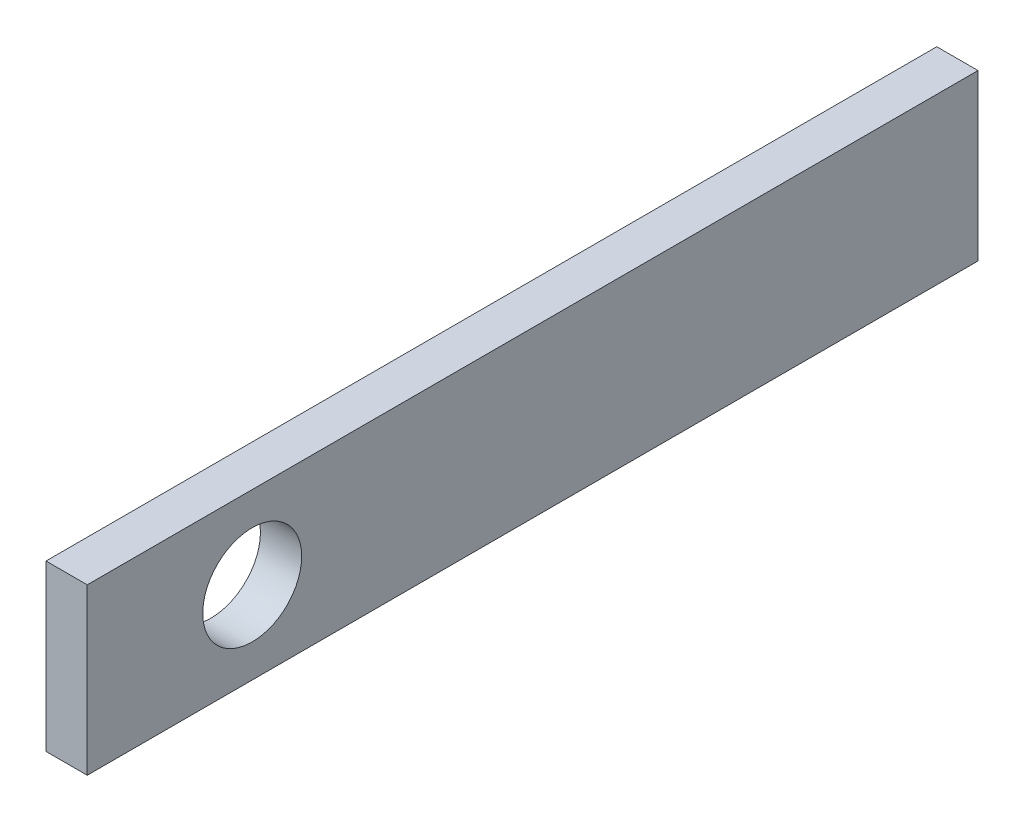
ISO-10303-21;
HEADER;
FILE_DESCRIPTION(('STEP AP214'),'2;1');
FILE_NAME('part.step','',(''),(''),'','','');
FILE_SCHEMA(('AUTOMOTIVE_DESIGN { 1 0 10303 214 1 1 1 1 }'));
ENDSEC;
DATA;
#1=APPLICATION_CONTEXT('core data for automotive mechanical design processes');
#2=APPLICATION_PROTOCOL_DEFINITION('international standard','automotive_design',2000,#1);
#3=PRODUCT_CONTEXT('',#1,'mechanical');
#4=PRODUCT('Part','Part','',(#3));
#5=PRODUCT_RELATED_PRODUCT_CATEGORY('part','',(#4));
#6=PRODUCT_DEFINITION_FORMATION('','',#4);
#7=PRODUCT_DEFINITION_CONTEXT('part definition',#1,'design');
#8=PRODUCT_DEFINITION('design','',#6,#7);
#9=PRODUCT_DEFINITION_SHAPE('','',#8);
#10=(LENGTH_UNIT() NAMED_UNIT(*) SI_UNIT(.MILLI.,.METRE.));
#11=(NAMED_UNIT(*) PLANE_ANGLE_UNIT() SI_UNIT($,.RADIAN.));
#12=(NAMED_UNIT(*) SI_UNIT($,.STERADIAN.) SOLID_ANGLE_UNIT());
#13=UNCERTAINTY_MEASURE_WITH_UNIT(LENGTH_MEASURE(1.E-05),#10,'distance_accuracy_value','');
#14=(GEOMETRIC_REPRESENTATION_CONTEXT(3) GLOBAL_UNCERTAINTY_ASSIGNED_CONTEXT((#13)) GLOBAL_UNIT_ASSIGNED_CONTEXT((#10,
#11,#12)) REPRESENTATION_CONTEXT('',''));
#15=CARTESIAN_POINT('',(0.,0.,0.));
#16=DIRECTION('',(0.,0.,1.));
#17=DIRECTION('',(1.,0.,0.));
#18=AXIS2_PLACEMENT_3D('',#15,#16,#17);
#19=CARTESIAN_POINT('',(3.175,0.,0.));
#20=DIRECTION('',(-1.,0.,0.));
#21=DIRECTION('',(0.,0.,1.));
#22=AXIS2_PLACEMENT_3D('',#19,#20,#21);
#23=PLANE('',#22);
#24=DIRECTION('',(0.,-1.,0.));
#25=VECTOR('',#24,1.);
#26=CARTESIAN_POINT('',(3.175,0.,0.));
#27=LINE('',#26,#25);
#28=CARTESIAN_POINT('',(3.175,12.7,0.));
#29=VERTEX_POINT('',#28);
#30=CARTESIAN_POINT('',(3.175,0.,0.));
#31=VERTEX_POINT('',#30);
#32=EDGE_CURVE('E85',#29,#31,#27,.T.);
#33=ORIENTED_EDGE('',*,*,#32,.T.);
#34=DIRECTION('',(0.,0.,-1.));
#35=VECTOR('',#34,1.);
#36=CARTESIAN_POINT('',(3.175,0.,0.));
#37=LINE('',#36,#35);
#38=CARTESIAN_POINT('',(3.175,0.,-68.58));
#39=VERTEX_POINT('',#38);
#40=EDGE_CURVE('E80',#31,#39,#37,.T.);
#41=ORIENTED_EDGE('',*,*,#40,.T.);
#42=DIRECTION('',(0.,1.,0.));
#43=VECTOR('',#42,1.);
#44=CARTESIAN_POINT('',(3.175,0.,-68.58));
#45=LINE('',#44,#43);
#46=CARTESIAN_POINT('',(3.175,12.7,-68.58));
#47=VERTEX_POINT('',#46);
#48=EDGE_CURVE('E83',#39,#47,#45,.T.);
#49=ORIENTED_EDGE('',*,*,#48,.T.);
#50=DIRECTION('',(0.,0.,1.));
#51=VECTOR('',#50,1.);
#52=CARTESIAN_POINT('',(3.175,12.7,0.));
#53=LINE('',#52,#51);
#54=EDGE_CURVE('E50',#47,#29,#53,.T.);
#55=ORIENTED_EDGE('',*,*,#54,.T.);
#56=EDGE_LOOP('',(#33,#41,#49,#55));
#57=FACE_BOUND('',#56,.T.);
#58=CARTESIAN_POINT('',(3.175,6.35,-12.7));
#59=DIRECTION('',(1.,0.,0.));
#60=DIRECTION('',(0.,0.,-1.));
#61=AXIS2_PLACEMENT_3D('',#58,#59,#60);
#62=CIRCLE('',#61,3.81);
#63=CARTESIAN_POINT('',(3.175,6.35,-16.51));
#64=VERTEX_POINT('',#63);
#65=EDGE_CURVE('E100',#64,#64,#62,.T.);
#66=ORIENTED_EDGE('',*,*,#65,.F.);
#67=EDGE_LOOP('',(#66));
#68=FACE_BOUND('',#67,.T.);
#69=ADVANCED_FACE('F33',(#57,#68),#23,.F.);
#70=CARTESIAN_POINT('',(0.,0.,0.));
#71=DIRECTION('',(-1.,0.,0.));
#72=DIRECTION('',(0.,0.,1.));
#73=AXIS2_PLACEMENT_3D('',#70,#71,#72);
#74=PLANE('',#73);
#75=DIRECTION('',(0.,-1.,0.));
#76=VECTOR('',#75,1.);
#77=CARTESIAN_POINT('',(0.,0.,0.));
#78=LINE('',#77,#76);
#79=CARTESIAN_POINT('',(0.,12.7,0.));
#80=VERTEX_POINT('',#79);
#81=CARTESIAN_POINT('',(0.,0.,0.));
#82=VERTEX_POINT('',#81);
#83=EDGE_CURVE('E97',#80,#82,#78,.T.);
#84=ORIENTED_EDGE('',*,*,#83,.F.);
#85=DIRECTION('',(0.,0.,1.));
#86=VECTOR('',#85,1.);
#87=CARTESIAN_POINT('',(0.,12.7,0.));
#88=LINE('',#87,#86);
#89=CARTESIAN_POINT('',(0.,12.7,-68.58));
#90=VERTEX_POINT('',#89);
#91=EDGE_CURVE('E73',#90,#80,#88,.T.);
#92=ORIENTED_EDGE('',*,*,#91,.F.);
#93=DIRECTION('',(0.,1.,0.));
#94=VECTOR('',#93,1.);
#95=CARTESIAN_POINT('',(0.,0.,-68.58));
#96=LINE('',#95,#94);
#97=CARTESIAN_POINT('',(0.,0.,-68.58));
#98=VERTEX_POINT('',#97);
#99=EDGE_CURVE('E67',#98,#90,#96,.T.);
#100=ORIENTED_EDGE('',*,*,#99,.F.);
#101=DIRECTION('',(0.,0.,-1.));
#102=VECTOR('',#101,1.);
#103=CARTESIAN_POINT('',(0.,0.,0.));
#104=LINE('',#103,#102);
#105=EDGE_CURVE('E89',#82,#98,#104,.T.);
#106=ORIENTED_EDGE('',*,*,#105,.F.);
#107=EDGE_LOOP('',(#84,#92,#100,#106));
#108=FACE_BOUND('',#107,.T.);
#109=CARTESIAN_POINT('',(0.,6.35,-12.7));
#110=DIRECTION('',(1.,0.,0.));
#111=DIRECTION('',(0.,0.,-1.));
#112=AXIS2_PLACEMENT_3D('',#109,#110,#111);
#113=CIRCLE('',#112,3.81);
#114=CARTESIAN_POINT('',(0.,6.35,-16.51));
#115=VERTEX_POINT('',#114);
#116=EDGE_CURVE('E112',#115,#115,#113,.T.);
#117=ORIENTED_EDGE('',*,*,#116,.T.);
#118=EDGE_LOOP('',(#117));
#119=FACE_BOUND('',#118,.T.);
#120=ADVANCED_FACE('F108',(#108,#119),#74,.T.);
#121=CARTESIAN_POINT('',(3.175,0.,0.));
#122=DIRECTION('',(0.,0.,-1.));
#123=DIRECTION('',(-1.,0.,0.));
#124=AXIS2_PLACEMENT_3D('',#121,#122,#123);
#125=PLANE('',#124);
#126=ORIENTED_EDGE('',*,*,#83,.T.);
#127=DIRECTION('',(-1.,0.,0.));
#128=VECTOR('',#127,1.);
#129=CARTESIAN_POINT('',(3.175,0.,0.));
#130=LINE('',#129,#128);
#131=EDGE_CURVE('E11',#31,#82,#130,.T.);
#132=ORIENTED_EDGE('',*,*,#131,.F.);
#133=ORIENTED_EDGE('',*,*,#32,.F.);
#134=DIRECTION('',(-1.,0.,0.));
#135=VECTOR('',#134,1.);
#136=CARTESIAN_POINT('',(3.175,12.7,0.));
#137=LINE('',#136,#135);
#138=EDGE_CURVE('E93',#29,#80,#137,.T.);
#139=ORIENTED_EDGE('',*,*,#138,.T.);
#140=EDGE_LOOP('',(#126,#132,#133,#139));
#141=FACE_BOUND('',#140,.T.);
#142=ADVANCED_FACE('F35',(#141),#125,.F.);
#143=CARTESIAN_POINT('',(3.175,0.,0.));
#144=DIRECTION('',(0.,1.,0.));
#145=DIRECTION('',(0.,0.,1.));
#146=AXIS2_PLACEMENT_3D('',#143,#144,#145);
#147=PLANE('',#146);
#148=ORIENTED_EDGE('',*,*,#105,.T.);
#149=DIRECTION('',(-1.,0.,0.));
#150=VECTOR('',#149,1.);
#151=CARTESIAN_POINT('',(3.175,0.,-68.58));
#152=LINE('',#151,#150);
#153=EDGE_CURVE('E42',#39,#98,#152,.T.);
#154=ORIENTED_EDGE('',*,*,#153,.F.);
#155=ORIENTED_EDGE('',*,*,#40,.F.);
#156=ORIENTED_EDGE('',*,*,#131,.T.);
#157=EDGE_LOOP('',(#148,#154,#155,#156));
#158=FACE_BOUND('',#157,.T.);
#159=ADVANCED_FACE('F88',(#158),#147,.F.);
#160=CARTESIAN_POINT('',(3.175,0.,-68.58));
#161=DIRECTION('',(0.,0.,1.));
#162=DIRECTION('',(1.,0.,0.));
#163=AXIS2_PLACEMENT_3D('',#160,#161,#162);
#164=PLANE('',#163);
#165=ORIENTED_EDGE('',*,*,#99,.T.);
#166=DIRECTION('',(-1.,0.,0.));
#167=VECTOR('',#166,1.);
#168=CARTESIAN_POINT('',(3.175,12.7,-68.58));
#169=LINE('',#168,#167);
#170=EDGE_CURVE('E90',#47,#90,#169,.T.);
#171=ORIENTED_EDGE('',*,*,#170,.F.);
#172=ORIENTED_EDGE('',*,*,#48,.F.);
#173=ORIENTED_EDGE('',*,*,#153,.T.);
#174=EDGE_LOOP('',(#165,#171,#172,#173));
#175=FACE_BOUND('',#174,.T.);
#176=ADVANCED_FACE('F91',(#175),#164,.F.);
#177=CARTESIAN_POINT('',(3.175,12.7,0.));
#178=DIRECTION('',(0.,-1.,0.));
#179=DIRECTION('',(0.,0.,-1.));
#180=AXIS2_PLACEMENT_3D('',#177,#178,#179);
#181=PLANE('',#180);
#182=ORIENTED_EDGE('',*,*,#91,.T.);
#183=ORIENTED_EDGE('',*,*,#138,.F.);
#184=ORIENTED_EDGE('',*,*,#54,.F.);
#185=ORIENTED_EDGE('',*,*,#170,.T.);
#186=EDGE_LOOP('',(#182,#183,#184,#185));
#187=FACE_BOUND('',#186,.T.);
#188=ADVANCED_FACE('F105',(#187),#181,.F.);
#189=CARTESIAN_POINT('',(3.175,6.35,-12.7));
#190=DIRECTION('',(-1.,0.,0.));
#191=DIRECTION('',(0.,0.,1.));
#192=AXIS2_PLACEMENT_3D('',#189,#190,#191);
#193=CYLINDRICAL_SURFACE('',#192,3.81);
#194=ORIENTED_EDGE('',*,*,#65,.T.);
#195=EDGE_LOOP('',(#194));
#196=FACE_BOUND('',#195,.T.);
#197=ORIENTED_EDGE('',*,*,#116,.F.);
#198=EDGE_LOOP('',(#197));
#199=FACE_BOUND('',#198,.T.);
#200=ADVANCED_FACE('F118',(#196,#199),#193,.F.);
#201=CLOSED_SHELL('',(#69,#120,#142,#159,#176,#188,#200));
#202=MANIFOLD_SOLID_BREP('B2',#201);
#203=ADVANCED_BREP_SHAPE_REPRESENTATION('',(#18,#202),#14);
#204=SHAPE_DEFINITION_REPRESENTATION(#9,#203);
ENDSEC;
END-ISO-10303-21;
